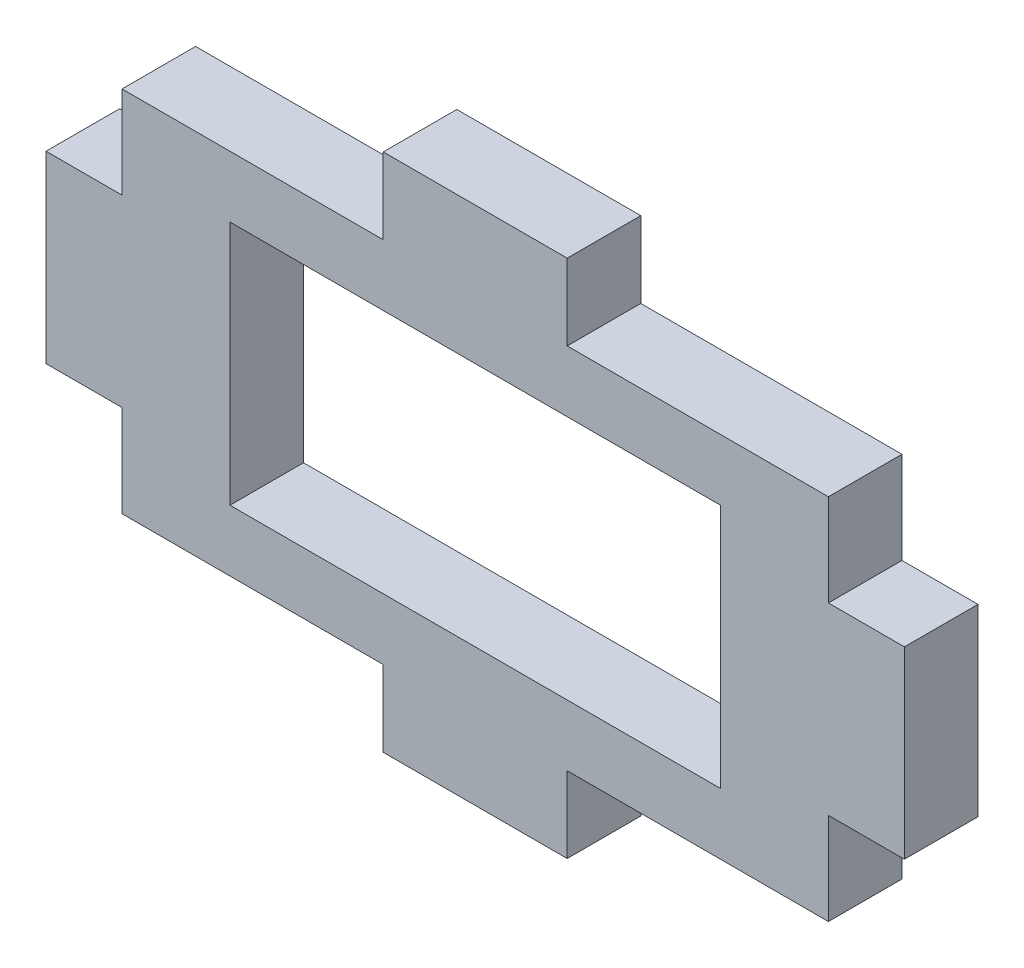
from build123d import *

# Parameters (mm, degrees)
SKETCH1_W           = 57.6
SKETCH1_H           = 30
BOSS_EXTRUDE1_DEPTH = 6
SKETCH2_W           = 15
SKETCH2_H           = 6.2
SKETCH2_W_2         = 6.2
SKETCH2_H_2         = 15
BOSS_EXTRUDE2_DEPTH = 6
SKETCH3_W           = 40
SKETCH3_H           = 20
CUT_EXTRUDE1_DEPTH  = 10


with BuildPart() as part:
    # Sketch1 → Boss-Extrude1 (new body)
    with BuildSketch(Plane.XY):
        Rectangle(SKETCH1_W, SKETCH1_H)
    extrude(amount=BOSS_EXTRUDE1_DEPTH)

    # Sketch2 → Boss-Extrude2 (add)
    with BuildSketch(Plane.XY.offset(6)):
        with Locations((0, 18.1)):
            Rectangle(SKETCH2_W, SKETCH2_H)
        with Locations((0, -18.1)):
            Rectangle(SKETCH2_W, SKETCH2_H)
        with Locations((-31.9, 0)):
            Rectangle(SKETCH2_W_2, SKETCH2_H_2)
        with Locations((31.9, 0)):
            Rectangle(SKETCH2_W_2, SKETCH2_H_2)
    extrude(amount=-BOSS_EXTRUDE2_DEPTH)

    # Sketch3 → Cut-Extrude1 (cut)
    with BuildSketch(Plane.XY.offset(6)):
        Rectangle(SKETCH3_W, SKETCH3_H)
    extrude(amount=-CUT_EXTRUDE1_DEPTH, mode=Mode.SUBTRACT)


solid = part.part
